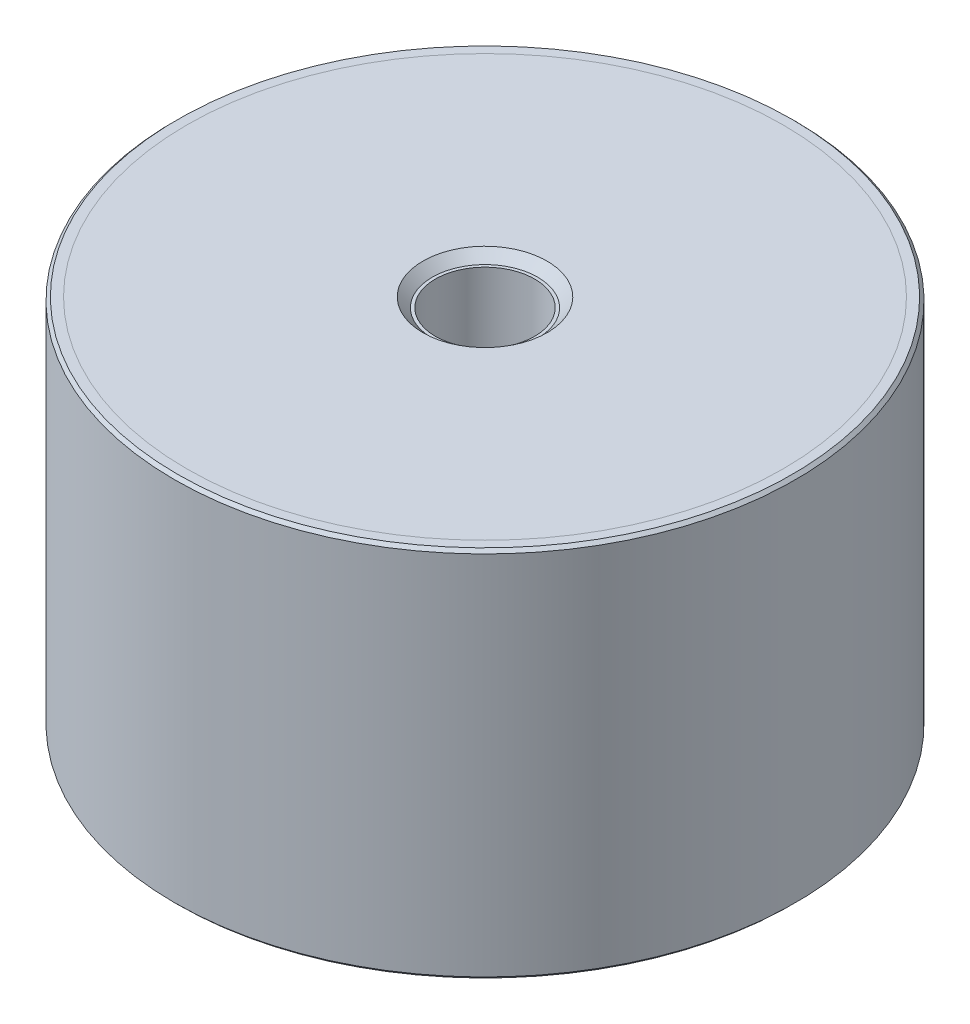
ISO-10303-21;
HEADER;
FILE_DESCRIPTION(('STEP AP214'),'2;1');
FILE_NAME('part.step','',(''),(''),'','','');
FILE_SCHEMA(('AUTOMOTIVE_DESIGN { 1 0 10303 214 1 1 1 1 }'));
ENDSEC;
DATA;
#1=APPLICATION_CONTEXT('core data for automotive mechanical design processes');
#2=APPLICATION_PROTOCOL_DEFINITION('international standard','automotive_design',2000,#1);
#3=PRODUCT_CONTEXT('',#1,'mechanical');
#4=PRODUCT('Part','Part','',(#3));
#5=PRODUCT_RELATED_PRODUCT_CATEGORY('part','',(#4));
#6=PRODUCT_DEFINITION_FORMATION('','',#4);
#7=PRODUCT_DEFINITION_CONTEXT('part definition',#1,'design');
#8=PRODUCT_DEFINITION('design','',#6,#7);
#9=PRODUCT_DEFINITION_SHAPE('','',#8);
#10=(LENGTH_UNIT() NAMED_UNIT(*) SI_UNIT(.MILLI.,.METRE.));
#11=(NAMED_UNIT(*) PLANE_ANGLE_UNIT() SI_UNIT($,.RADIAN.));
#12=(NAMED_UNIT(*) SI_UNIT($,.STERADIAN.) SOLID_ANGLE_UNIT());
#13=UNCERTAINTY_MEASURE_WITH_UNIT(LENGTH_MEASURE(1.E-05),#10,'distance_accuracy_value','');
#14=(GEOMETRIC_REPRESENTATION_CONTEXT(3) GLOBAL_UNCERTAINTY_ASSIGNED_CONTEXT((#13)) GLOBAL_UNIT_ASSIGNED_CONTEXT((#10,
#11,#12)) REPRESENTATION_CONTEXT('',''));
#15=CARTESIAN_POINT('',(0.,0.,0.));
#16=DIRECTION('',(0.,0.,1.));
#17=DIRECTION('',(1.,0.,0.));
#18=AXIS2_PLACEMENT_3D('',#15,#16,#17);
#19=CARTESIAN_POINT('',(0.,-57.,8.));
#20=DIRECTION('',(0.,1.,0.));
#21=DIRECTION('',(0.,0.,1.));
#22=AXIS2_PLACEMENT_3D('',#19,#20,#21);
#23=PLANE('',#22);
#24=CARTESIAN_POINT('',(0.,-57.,0.));
#25=DIRECTION('',(0.,1.,0.));
#26=DIRECTION('',(0.,0.,1.));
#27=AXIS2_PLACEMENT_3D('',#24,#25,#26);
#28=CIRCLE('',#27,8.50000000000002);
#29=CARTESIAN_POINT('',(0.,-57.,8.50000000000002));
#30=VERTEX_POINT('',#29);
#31=EDGE_CURVE('P0_E10',#30,#30,#28,.F.);
#32=ORIENTED_EDGE('',*,*,#31,.T.);
#33=EDGE_LOOP('',(#32));
#34=FACE_BOUND('',#33,.T.);
#35=CARTESIAN_POINT('',(0.,-57.,0.));
#36=DIRECTION('',(0.,1.,0.));
#37=DIRECTION('',(0.,0.,1.));
#38=AXIS2_PLACEMENT_3D('',#35,#36,#37);
#39=CIRCLE('',#38,48.);
#40=CARTESIAN_POINT('',(0.,-57.,48.));
#41=VERTEX_POINT('',#40);
#42=EDGE_CURVE('P0_E25',#41,#41,#39,.T.);
#43=ORIENTED_EDGE('',*,*,#42,.T.);
#44=EDGE_LOOP('',(#43));
#45=FACE_BOUND('',#44,.T.);
#46=ADVANCED_FACE('P0_F14',(#34,#45),#23,.T.);
#47=CARTESIAN_POINT('',(0.,11.0340428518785,0.));
#48=DIRECTION('',(0.,1.,0.));
#49=DIRECTION('',(0.,0.,1.));
#50=AXIS2_PLACEMENT_3D('',#47,#48,#49);
#51=CYLINDRICAL_SURFACE('',#50,48.);
#52=CARTESIAN_POINT('',(0.,-58.5,0.));
#53=DIRECTION('',(0.,1.,0.));
#54=DIRECTION('',(0.,0.,1.));
#55=AXIS2_PLACEMENT_3D('',#52,#53,#54);
#56=CIRCLE('',#55,48.);
#57=CARTESIAN_POINT('',(0.,-58.5,48.));
#58=VERTEX_POINT('',#57);
#59=EDGE_CURVE('P0_E29',#58,#58,#56,.T.);
#60=ORIENTED_EDGE('',*,*,#59,.T.);
#61=EDGE_LOOP('',(#60));
#62=FACE_BOUND('',#61,.T.);
#63=ORIENTED_EDGE('',*,*,#42,.F.);
#64=EDGE_LOOP('',(#63));
#65=FACE_BOUND('',#64,.T.);
#66=ADVANCED_FACE('P0_F35',(#62,#65),#51,.T.);
#67=CARTESIAN_POINT('',(0.,-58.5,48.));
#68=DIRECTION('',(0.,-1.,0.));
#69=DIRECTION('',(0.,0.,-1.));
#70=AXIS2_PLACEMENT_3D('',#67,#68,#69);
#71=PLANE('',#70);
#72=CARTESIAN_POINT('',(0.,-58.5,0.));
#73=DIRECTION('',(0.,-1.,0.));
#74=DIRECTION('',(0.,0.,-1.));
#75=AXIS2_PLACEMENT_3D('',#72,#73,#74);
#76=CIRCLE('',#75,10.);
#77=CARTESIAN_POINT('',(0.,-58.5,-10.));
#78=VERTEX_POINT('',#77);
#79=EDGE_CURVE('P0_E21',#78,#78,#76,.F.);
#80=ORIENTED_EDGE('',*,*,#79,.T.);
#81=EDGE_LOOP('',(#80));
#82=FACE_BOUND('',#81,.T.);
#83=ORIENTED_EDGE('',*,*,#59,.F.);
#84=EDGE_LOOP('',(#83));
#85=FACE_BOUND('',#84,.T.);
#86=ADVANCED_FACE('P0_F38',(#82,#85),#71,.T.);
#87=CARTESIAN_POINT('',(0.,-58.5,0.));
#88=DIRECTION('',(0.,-1.,0.));
#89=DIRECTION('',(0.,0.,-1.));
#90=AXIS2_PLACEMENT_3D('',#87,#88,#89);
#91=CONICAL_SURFACE('',#90,10.,0.785398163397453);
#92=ORIENTED_EDGE('',*,*,#31,.F.);
#93=EDGE_LOOP('',(#92));
#94=FACE_BOUND('',#93,.T.);
#95=ORIENTED_EDGE('',*,*,#79,.F.);
#96=EDGE_LOOP('',(#95));
#97=FACE_BOUND('',#96,.T.);
#98=ADVANCED_FACE('P0_F16',(#94,#97),#91,.F.);
#99=CLOSED_SHELL('',(#46,#66,#86,#98));
#100=MANIFOLD_SOLID_BREP('P0_B1',#99);
#101=CARTESIAN_POINT('',(0.,1.5,8.));
#102=DIRECTION('',(0.,1.,0.));
#103=DIRECTION('',(0.,0.,1.));
#104=AXIS2_PLACEMENT_3D('',#101,#102,#103);
#105=PLANE('',#104);
#106=CARTESIAN_POINT('',(0.,1.5,0.));
#107=DIRECTION('',(0.,1.,0.));
#108=DIRECTION('',(0.,0.,1.));
#109=AXIS2_PLACEMENT_3D('',#106,#107,#108);
#110=CIRCLE('',#109,10.);
#111=CARTESIAN_POINT('',(0.,1.5,10.));
#112=VERTEX_POINT('',#111);
#113=EDGE_CURVE('P1_E10',#112,#112,#110,.F.);
#114=ORIENTED_EDGE('',*,*,#113,.T.);
#115=EDGE_LOOP('',(#114));
#116=FACE_BOUND('',#115,.T.);
#117=CARTESIAN_POINT('',(0.,1.5,0.));
#118=DIRECTION('',(0.,1.,0.));
#119=DIRECTION('',(0.,0.,1.));
#120=AXIS2_PLACEMENT_3D('',#117,#118,#119);
#121=CIRCLE('',#120,48.);
#122=CARTESIAN_POINT('',(0.,1.5,48.));
#123=VERTEX_POINT('',#122);
#124=EDGE_CURVE('P1_E25',#123,#123,#121,.T.);
#125=ORIENTED_EDGE('',*,*,#124,.T.);
#126=EDGE_LOOP('',(#125));
#127=FACE_BOUND('',#126,.T.);
#128=ADVANCED_FACE('P1_F14',(#116,#127),#105,.T.);
#129=CARTESIAN_POINT('',(0.,69.5340428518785,0.));
#130=DIRECTION('',(0.,1.,0.));
#131=DIRECTION('',(0.,0.,1.));
#132=AXIS2_PLACEMENT_3D('',#129,#130,#131);
#133=CYLINDRICAL_SURFACE('',#132,48.);
#134=CARTESIAN_POINT('',(0.,0.,0.));
#135=DIRECTION('',(0.,1.,0.));
#136=DIRECTION('',(0.,0.,1.));
#137=AXIS2_PLACEMENT_3D('',#134,#135,#136);
#138=CIRCLE('',#137,48.);
#139=CARTESIAN_POINT('',(0.,0.,48.));
#140=VERTEX_POINT('',#139);
#141=EDGE_CURVE('P1_E29',#140,#140,#138,.T.);
#142=ORIENTED_EDGE('',*,*,#141,.T.);
#143=EDGE_LOOP('',(#142));
#144=FACE_BOUND('',#143,.T.);
#145=ORIENTED_EDGE('',*,*,#124,.F.);
#146=EDGE_LOOP('',(#145));
#147=FACE_BOUND('',#146,.T.);
#148=ADVANCED_FACE('P1_F35',(#144,#147),#133,.T.);
#149=CARTESIAN_POINT('',(0.,0.,48.));
#150=DIRECTION('',(0.,-1.,0.));
#151=DIRECTION('',(0.,0.,-1.));
#152=AXIS2_PLACEMENT_3D('',#149,#150,#151);
#153=PLANE('',#152);
#154=CARTESIAN_POINT('',(0.,0.,0.));
#155=DIRECTION('',(0.,-1.,0.));
#156=DIRECTION('',(0.,0.,-1.));
#157=AXIS2_PLACEMENT_3D('',#154,#155,#156);
#158=CIRCLE('',#157,8.50000000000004);
#159=CARTESIAN_POINT('',(0.,0.,-8.50000000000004));
#160=VERTEX_POINT('',#159);
#161=EDGE_CURVE('P1_E21',#160,#160,#158,.F.);
#162=ORIENTED_EDGE('',*,*,#161,.T.);
#163=EDGE_LOOP('',(#162));
#164=FACE_BOUND('',#163,.T.);
#165=ORIENTED_EDGE('',*,*,#141,.F.);
#166=EDGE_LOOP('',(#165));
#167=FACE_BOUND('',#166,.T.);
#168=ADVANCED_FACE('P1_F38',(#164,#167),#153,.T.);
#169=CARTESIAN_POINT('',(0.,-0.500000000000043,0.));
#170=DIRECTION('',(0.,1.,0.));
#171=DIRECTION('',(0.,0.,1.));
#172=AXIS2_PLACEMENT_3D('',#169,#170,#171);
#173=CONICAL_SURFACE('',#172,8.,0.785398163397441);
#174=ORIENTED_EDGE('',*,*,#113,.F.);
#175=EDGE_LOOP('',(#174));
#176=FACE_BOUND('',#175,.T.);
#177=ORIENTED_EDGE('',*,*,#161,.F.);
#178=EDGE_LOOP('',(#177));
#179=FACE_BOUND('',#178,.T.);
#180=ADVANCED_FACE('P1_F16',(#176,#179),#173,.F.);
#181=CLOSED_SHELL('',(#128,#148,#168,#180));
#182=MANIFOLD_SOLID_BREP('P1_B1',#181);
#183=CARTESIAN_POINT('',(0.,0.,0.));
#184=DIRECTION('',(0.,1.,0.));
#185=DIRECTION('',(0.,0.,1.));
#186=AXIS2_PLACEMENT_3D('',#183,#184,#185);
#187=PLANE('',#186);
#188=CARTESIAN_POINT('',(0.,0.,0.));
#189=DIRECTION('',(0.,1.,0.));
#190=DIRECTION('',(0.,0.,1.));
#191=AXIS2_PLACEMENT_3D('',#188,#189,#190);
#192=CIRCLE('',#191,8.);
#193=CARTESIAN_POINT('',(0.,0.,8.));
#194=VERTEX_POINT('',#193);
#195=EDGE_CURVE('P2_E46',#194,#194,#192,.T.);
#196=ORIENTED_EDGE('',*,*,#195,.F.);
#197=EDGE_LOOP('',(#196));
#198=FACE_BOUND('',#197,.T.);
#199=CARTESIAN_POINT('',(0.,0.,0.));
#200=DIRECTION('',(0.,1.,0.));
#201=DIRECTION('',(0.,0.,1.));
#202=AXIS2_PLACEMENT_3D('',#199,#200,#201);
#203=CIRCLE('',#202,48.);
#204=CARTESIAN_POINT('',(0.,0.,48.));
#205=VERTEX_POINT('',#204);
#206=EDGE_CURVE('P2_E33',#205,#205,#203,.T.);
#207=ORIENTED_EDGE('',*,*,#206,.T.);
#208=EDGE_LOOP('',(#207));
#209=FACE_BOUND('',#208,.T.);
#210=ADVANCED_FACE('P2_F13',(#198,#209),#187,.T.);
#211=CARTESIAN_POINT('',(0.,65.5134936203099,0.));
#212=DIRECTION('',(0.,1.,0.));
#213=DIRECTION('',(0.,0.,1.));
#214=AXIS2_PLACEMENT_3D('',#211,#212,#213);
#215=CYLINDRICAL_SURFACE('',#214,48.);
#216=CARTESIAN_POINT('',(0.,1.49999999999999,0.));
#217=DIRECTION('',(0.,1.,0.));
#218=DIRECTION('',(0.,0.,1.));
#219=AXIS2_PLACEMENT_3D('',#216,#217,#218);
#220=CIRCLE('',#219,48.);
#221=CARTESIAN_POINT('',(0.,1.49999999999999,48.));
#222=VERTEX_POINT('',#221);
#223=EDGE_CURVE('P2_E36',#222,#222,#220,.T.);
#224=ORIENTED_EDGE('',*,*,#223,.T.);
#225=EDGE_LOOP('',(#224));
#226=FACE_BOUND('',#225,.T.);
#227=ORIENTED_EDGE('',*,*,#206,.F.);
#228=EDGE_LOOP('',(#227));
#229=FACE_BOUND('',#228,.T.);
#230=ADVANCED_FACE('P2_F92',(#226,#229),#215,.F.);
#231=CARTESIAN_POINT('',(0.,1.49999999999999,48.));
#232=DIRECTION('',(0.,1.,0.));
#233=DIRECTION('',(0.,0.,1.));
#234=AXIS2_PLACEMENT_3D('',#231,#232,#233);
#235=PLANE('',#234);
#236=CARTESIAN_POINT('',(0.,1.49999999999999,0.));
#237=DIRECTION('',(0.,1.,0.));
#238=DIRECTION('',(0.,0.,1.));
#239=AXIS2_PLACEMENT_3D('',#236,#237,#238);
#240=CIRCLE('',#239,49.5);
#241=CARTESIAN_POINT('',(0.,1.49999999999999,49.5));
#242=VERTEX_POINT('',#241);
#243=EDGE_CURVE('P2_E9',#242,#242,#240,.T.);
#244=ORIENTED_EDGE('',*,*,#243,.T.);
#245=EDGE_LOOP('',(#244));
#246=FACE_BOUND('',#245,.T.);
#247=ORIENTED_EDGE('',*,*,#223,.F.);
#248=EDGE_LOOP('',(#247));
#249=FACE_BOUND('',#248,.T.);
#250=ADVANCED_FACE('P2_F88',(#246,#249),#235,.T.);
#251=CARTESIAN_POINT('',(0.,65.5134936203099,0.));
#252=DIRECTION('',(0.,1.,0.));
#253=DIRECTION('',(0.,0.,1.));
#254=AXIS2_PLACEMENT_3D('',#251,#252,#253);
#255=CYLINDRICAL_SURFACE('',#254,50.);
#256=CARTESIAN_POINT('',(0.,-58.,0.));
#257=DIRECTION('',(0.,-1.,0.));
#258=DIRECTION('',(0.,0.,-1.));
#259=AXIS2_PLACEMENT_3D('',#256,#257,#258);
#260=CIRCLE('',#259,50.);
#261=CARTESIAN_POINT('',(0.,-58.,-50.));
#262=VERTEX_POINT('',#261);
#263=EDGE_CURVE('P2_E24',#262,#262,#260,.F.);
#264=ORIENTED_EDGE('',*,*,#263,.T.);
#265=EDGE_LOOP('',(#264));
#266=FACE_BOUND('',#265,.T.);
#267=CARTESIAN_POINT('',(0.,0.999999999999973,0.));
#268=DIRECTION('',(0.,1.,0.));
#269=DIRECTION('',(0.,0.,1.));
#270=AXIS2_PLACEMENT_3D('',#267,#268,#269);
#271=CIRCLE('',#270,50.);
#272=CARTESIAN_POINT('',(0.,0.999999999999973,50.));
#273=VERTEX_POINT('',#272);
#274=EDGE_CURVE('P2_E28',#273,#273,#271,.F.);
#275=ORIENTED_EDGE('',*,*,#274,.T.);
#276=EDGE_LOOP('',(#275));
#277=FACE_BOUND('',#276,.T.);
#278=ADVANCED_FACE('P2_F82',(#266,#277),#255,.T.);
#279=CARTESIAN_POINT('',(0.,-58.5,50.));
#280=DIRECTION('',(0.,-1.,0.));
#281=DIRECTION('',(0.,0.,-1.));
#282=AXIS2_PLACEMENT_3D('',#279,#280,#281);
#283=PLANE('',#282);
#284=CARTESIAN_POINT('',(0.,-58.5,0.));
#285=DIRECTION('',(0.,-1.,0.));
#286=DIRECTION('',(0.,0.,-1.));
#287=AXIS2_PLACEMENT_3D('',#284,#285,#286);
#288=CIRCLE('',#287,49.5);
#289=CARTESIAN_POINT('',(0.,-58.5,-49.5));
#290=VERTEX_POINT('',#289);
#291=EDGE_CURVE('P2_E20',#290,#290,#288,.T.);
#292=ORIENTED_EDGE('',*,*,#291,.T.);
#293=EDGE_LOOP('',(#292));
#294=FACE_BOUND('',#293,.T.);
#295=CARTESIAN_POINT('',(0.,-58.5,0.));
#296=DIRECTION('',(0.,1.,0.));
#297=DIRECTION('',(0.,0.,1.));
#298=AXIS2_PLACEMENT_3D('',#295,#296,#297);
#299=CIRCLE('',#298,48.);
#300=CARTESIAN_POINT('',(0.,-58.5,48.));
#301=VERTEX_POINT('',#300);
#302=EDGE_CURVE('P2_E39',#301,#301,#299,.T.);
#303=ORIENTED_EDGE('',*,*,#302,.T.);
#304=EDGE_LOOP('',(#303));
#305=FACE_BOUND('',#304,.T.);
#306=ADVANCED_FACE('P2_F77',(#294,#305),#283,.T.);
#307=CARTESIAN_POINT('',(0.,65.5134936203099,0.));
#308=DIRECTION('',(0.,1.,0.));
#309=DIRECTION('',(0.,0.,1.));
#310=AXIS2_PLACEMENT_3D('',#307,#308,#309);
#311=CYLINDRICAL_SURFACE('',#310,48.);
#312=CARTESIAN_POINT('',(0.,-57.,0.));
#313=DIRECTION('',(0.,1.,0.));
#314=DIRECTION('',(0.,0.,1.));
#315=AXIS2_PLACEMENT_3D('',#312,#313,#314);
#316=CIRCLE('',#315,48.);
#317=CARTESIAN_POINT('',(0.,-57.,48.));
#318=VERTEX_POINT('',#317);
#319=EDGE_CURVE('P2_E42',#318,#318,#316,.T.);
#320=ORIENTED_EDGE('',*,*,#319,.T.);
#321=EDGE_LOOP('',(#320));
#322=FACE_BOUND('',#321,.T.);
#323=ORIENTED_EDGE('',*,*,#302,.F.);
#324=EDGE_LOOP('',(#323));
#325=FACE_BOUND('',#324,.T.);
#326=ADVANCED_FACE('P2_F71',(#322,#325),#311,.F.);
#327=CARTESIAN_POINT('',(0.,-57.,48.));
#328=DIRECTION('',(0.,-1.,0.));
#329=DIRECTION('',(0.,0.,-1.));
#330=AXIS2_PLACEMENT_3D('',#327,#328,#329);
#331=PLANE('',#330);
#332=CARTESIAN_POINT('',(0.,-57.,0.));
#333=DIRECTION('',(0.,-1.,0.));
#334=DIRECTION('',(0.,0.,-1.));
#335=AXIS2_PLACEMENT_3D('',#332,#333,#334);
#336=CIRCLE('',#335,8.);
#337=CARTESIAN_POINT('',(0.,-57.,-8.));
#338=VERTEX_POINT('',#337);
#339=EDGE_CURVE('P2_E52',#338,#338,#336,.T.);
#340=ORIENTED_EDGE('',*,*,#339,.F.);
#341=EDGE_LOOP('',(#340));
#342=FACE_BOUND('',#341,.T.);
#343=ORIENTED_EDGE('',*,*,#319,.F.);
#344=EDGE_LOOP('',(#343));
#345=FACE_BOUND('',#344,.T.);
#346=ADVANCED_FACE('P2_F67',(#342,#345),#331,.T.);
#347=CARTESIAN_POINT('',(0.,-58.,0.));
#348=DIRECTION('',(0.,1.,0.));
#349=DIRECTION('',(0.,0.,1.));
#350=AXIS2_PLACEMENT_3D('',#347,#348,#349);
#351=CONICAL_SURFACE('',#350,50.,0.785398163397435);
#352=ORIENTED_EDGE('',*,*,#291,.F.);
#353=EDGE_LOOP('',(#352));
#354=FACE_BOUND('',#353,.T.);
#355=ORIENTED_EDGE('',*,*,#263,.F.);
#356=EDGE_LOOP('',(#355));
#357=FACE_BOUND('',#356,.T.);
#358=ADVANCED_FACE('P2_F70',(#354,#357),#351,.T.);
#359=CARTESIAN_POINT('',(0.,1.49999999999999,0.));
#360=DIRECTION('',(0.,-1.,0.));
#361=DIRECTION('',(0.,0.,-1.));
#362=AXIS2_PLACEMENT_3D('',#359,#360,#361);
#363=CONICAL_SURFACE('',#362,49.5,0.785398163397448);
#364=ORIENTED_EDGE('',*,*,#274,.F.);
#365=EDGE_LOOP('',(#364));
#366=FACE_BOUND('',#365,.T.);
#367=ORIENTED_EDGE('',*,*,#243,.F.);
#368=EDGE_LOOP('',(#367));
#369=FACE_BOUND('',#368,.T.);
#370=ADVANCED_FACE('P2_F15',(#366,#369),#363,.T.);
#371=CARTESIAN_POINT('',(0.,-14.5,0.));
#372=DIRECTION('',(0.,1.,0.));
#373=DIRECTION('',(0.,0.,1.));
#374=AXIS2_PLACEMENT_3D('',#371,#372,#373);
#375=CYLINDRICAL_SURFACE('',#374,8.);
#376=CARTESIAN_POINT('',(0.,-14.5,0.));
#377=DIRECTION('',(0.,1.,0.));
#378=DIRECTION('',(0.,0.,1.));
#379=AXIS2_PLACEMENT_3D('',#376,#377,#378);
#380=CIRCLE('',#379,8.);
#381=CARTESIAN_POINT('',(0.,-14.5,8.));
#382=VERTEX_POINT('',#381);
#383=EDGE_CURVE('P2_E45',#382,#382,#380,.T.);
#384=CARTESIAN_POINT('',(0.,-14.5,8.));
#385=CARTESIAN_POINT('',(0.,-14.3489583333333,8.));
#386=CARTESIAN_POINT('',(0.,-14.1979166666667,8.));
#387=CARTESIAN_POINT('',(0.,-13.8958333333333,8.));
#388=CARTESIAN_POINT('',(0.,-13.7447916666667,8.));
#389=CARTESIAN_POINT('',(0.,-13.4427083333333,8.));
#390=CARTESIAN_POINT('',(0.,-13.2916666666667,8.));
#391=CARTESIAN_POINT('',(0.,-12.9895833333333,8.));
#392=CARTESIAN_POINT('',(0.,-12.8385416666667,8.));
#393=CARTESIAN_POINT('',(0.,-12.5364583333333,8.));
#394=CARTESIAN_POINT('',(0.,-12.3854166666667,8.));
#395=CARTESIAN_POINT('',(0.,-12.0833333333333,8.));
#396=CARTESIAN_POINT('',(0.,-11.9322916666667,8.));
#397=CARTESIAN_POINT('',(0.,-11.6302083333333,8.));
#398=CARTESIAN_POINT('',(0.,-11.4791666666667,8.));
#399=CARTESIAN_POINT('',(0.,-11.1770833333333,8.));
#400=CARTESIAN_POINT('',(0.,-11.0260416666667,8.));
#401=CARTESIAN_POINT('',(0.,-10.7239583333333,8.));
#402=CARTESIAN_POINT('',(0.,-10.5729166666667,8.));
#403=CARTESIAN_POINT('',(0.,-10.2708333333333,8.));
#404=CARTESIAN_POINT('',(0.,-10.1197916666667,8.));
#405=CARTESIAN_POINT('',(0.,-9.81770833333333,8.));
#406=CARTESIAN_POINT('',(0.,-9.66666666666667,8.));
#407=CARTESIAN_POINT('',(0.,-9.36458333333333,8.));
#408=CARTESIAN_POINT('',(0.,-9.21354166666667,8.));
#409=CARTESIAN_POINT('',(0.,-8.91145833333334,8.));
#410=CARTESIAN_POINT('',(0.,-8.76041666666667,8.));
#411=CARTESIAN_POINT('',(0.,-8.45833333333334,8.));
#412=CARTESIAN_POINT('',(0.,-8.30729166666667,8.));
#413=CARTESIAN_POINT('',(0.,-8.00520833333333,8.));
#414=CARTESIAN_POINT('',(0.,-7.85416666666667,8.));
#415=CARTESIAN_POINT('',(0.,-7.55208333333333,8.));
#416=CARTESIAN_POINT('',(0.,-7.40104166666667,8.));
#417=CARTESIAN_POINT('',(0.,-7.09895833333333,8.));
#418=CARTESIAN_POINT('',(0.,-6.94791666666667,8.));
#419=CARTESIAN_POINT('',(0.,-6.64583333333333,8.));
#420=CARTESIAN_POINT('',(0.,-6.49479166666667,8.));
#421=CARTESIAN_POINT('',(0.,-6.19270833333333,8.));
#422=CARTESIAN_POINT('',(0.,-6.04166666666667,8.));
#423=CARTESIAN_POINT('',(0.,-5.73958333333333,8.));
#424=CARTESIAN_POINT('',(0.,-5.58854166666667,8.));
#425=CARTESIAN_POINT('',(0.,-5.28645833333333,8.));
#426=CARTESIAN_POINT('',(0.,-5.13541666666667,8.));
#427=CARTESIAN_POINT('',(0.,-4.83333333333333,8.));
#428=CARTESIAN_POINT('',(0.,-4.68229166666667,8.));
#429=CARTESIAN_POINT('',(0.,-4.38020833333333,8.));
#430=CARTESIAN_POINT('',(0.,-4.22916666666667,8.));
#431=CARTESIAN_POINT('',(0.,-3.92708333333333,8.));
#432=CARTESIAN_POINT('',(0.,-3.77604166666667,8.));
#433=CARTESIAN_POINT('',(0.,-3.47395833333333,8.));
#434=CARTESIAN_POINT('',(0.,-3.32291666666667,8.));
#435=CARTESIAN_POINT('',(0.,-3.02083333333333,8.));
#436=CARTESIAN_POINT('',(0.,-2.86979166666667,8.));
#437=CARTESIAN_POINT('',(0.,-2.56770833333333,8.));
#438=CARTESIAN_POINT('',(0.,-2.41666666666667,8.));
#439=CARTESIAN_POINT('',(0.,-2.11458333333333,8.));
#440=CARTESIAN_POINT('',(0.,-1.96354166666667,8.));
#441=CARTESIAN_POINT('',(0.,-1.66145833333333,8.));
#442=CARTESIAN_POINT('',(0.,-1.51041666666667,8.));
#443=CARTESIAN_POINT('',(0.,-1.20833333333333,8.));
#444=CARTESIAN_POINT('',(0.,-1.05729166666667,8.));
#445=CARTESIAN_POINT('',(0.,-0.755208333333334,8.));
#446=CARTESIAN_POINT('',(0.,-0.604166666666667,8.));
#447=CARTESIAN_POINT('',(0.,-0.302083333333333,8.));
#448=CARTESIAN_POINT('',(0.,-0.151041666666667,8.));
#449=CARTESIAN_POINT('',(0.,0.,8.));
#450=B_SPLINE_CURVE_WITH_KNOTS('',3,(#384,#385,#386,#387,#388,#389,#390,#391,#392,#393,#394,
#395,#396,#397,#398,#399,#400,#401,#402,#403,#404,#405,#406,#407,#408,#409,#410,#411,#412,#413,
#414,#415,#416,#417,#418,#419,#420,#421,#422,#423,#424,#425,#426,#427,#428,#429,#430,#431,#432,
#433,#434,#435,#436,#437,#438,#439,#440,#441,#442,#443,#444,#445,#446,#447,#448,#449),
.UNSPECIFIED.,.F.,.F.,(4,2,2,2,2,2,2,2,2,2,2,2,2,2,2,2,2,2,2,2,2,2,2,2,2,2,2,2,2,2,2,2,4),(0.,
0.453124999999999,0.906249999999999,1.359375,1.8125,2.265625,2.71875,3.171875,3.625,4.078125,
4.53125,4.984375,5.4375,5.890625,6.34375,6.796875,7.25,7.703125,8.15625,8.609375,9.0625,
9.515625,9.96875,10.421875,10.875,11.328125,11.78125,12.234375,12.6875,13.140625,13.59375,
14.046875,14.5),.UNSPECIFIED.);
#451=EDGE_CURVE('P2_BSEAM108',#382,#194,#450,.T.);
#452=ORIENTED_EDGE('',*,*,#383,.F.);
#453=ORIENTED_EDGE('',*,*,#195,.T.);
#454=ORIENTED_EDGE('',*,*,#451,.T.);
#455=ORIENTED_EDGE('',*,*,#451,.F.);
#456=EDGE_LOOP('',(#452,#454,#453,#455));
#457=FACE_BOUND('',#456,.T.);
#458=ADVANCED_FACE('P2_F108',(#457),#375,.F.);
#459=CARTESIAN_POINT('',(0.,-14.5,0.));
#460=DIRECTION('',(0.,1.,0.));
#461=DIRECTION('',(0.,0.,1.));
#462=AXIS2_PLACEMENT_3D('',#459,#460,#461);
#463=PLANE('',#462);
#464=ORIENTED_EDGE('',*,*,#383,.T.);
#465=EDGE_LOOP('',(#464));
#466=FACE_BOUND('',#465,.T.);
#467=ADVANCED_FACE('P2_F63',(#466),#463,.T.);
#468=CARTESIAN_POINT('',(0.,-42.5,0.));
#469=DIRECTION('',(0.,-1.,0.));
#470=DIRECTION('',(0.,0.,-1.));
#471=AXIS2_PLACEMENT_3D('',#468,#469,#470);
#472=CYLINDRICAL_SURFACE('',#471,8.);
#473=CARTESIAN_POINT('',(0.,-42.5,0.));
#474=DIRECTION('',(0.,-1.,0.));
#475=DIRECTION('',(0.,0.,-1.));
#476=AXIS2_PLACEMENT_3D('',#473,#474,#475);
#477=CIRCLE('',#476,8.);
#478=CARTESIAN_POINT('',(0.,-42.5,-8.));
#479=VERTEX_POINT('',#478);
#480=EDGE_CURVE('P2_E49',#479,#479,#477,.T.);
#481=CARTESIAN_POINT('',(0.,-42.5,-8.));
#482=CARTESIAN_POINT('',(0.,-42.6510416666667,-8.));
#483=CARTESIAN_POINT('',(0.,-42.8020833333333,-8.));
#484=CARTESIAN_POINT('',(0.,-43.1041666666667,-8.));
#485=CARTESIAN_POINT('',(0.,-43.2552083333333,-8.));
#486=CARTESIAN_POINT('',(0.,-43.5572916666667,-8.));
#487=CARTESIAN_POINT('',(0.,-43.7083333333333,-8.));
#488=CARTESIAN_POINT('',(0.,-44.0104166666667,-8.));
#489=CARTESIAN_POINT('',(0.,-44.1614583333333,-8.));
#490=CARTESIAN_POINT('',(0.,-44.4635416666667,-8.));
#491=CARTESIAN_POINT('',(0.,-44.6145833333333,-8.));
#492=CARTESIAN_POINT('',(0.,-44.9166666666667,-8.));
#493=CARTESIAN_POINT('',(0.,-45.0677083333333,-8.));
#494=CARTESIAN_POINT('',(0.,-45.3697916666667,-8.));
#495=CARTESIAN_POINT('',(0.,-45.5208333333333,-8.));
#496=CARTESIAN_POINT('',(0.,-45.8229166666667,-8.));
#497=CARTESIAN_POINT('',(0.,-45.9739583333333,-8.));
#498=CARTESIAN_POINT('',(0.,-46.2760416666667,-8.));
#499=CARTESIAN_POINT('',(0.,-46.4270833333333,-8.));
#500=CARTESIAN_POINT('',(0.,-46.7291666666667,-8.));
#501=CARTESIAN_POINT('',(0.,-46.8802083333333,-8.));
#502=CARTESIAN_POINT('',(0.,-47.1822916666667,-8.));
#503=CARTESIAN_POINT('',(0.,-47.3333333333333,-8.));
#504=CARTESIAN_POINT('',(0.,-47.6354166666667,-8.));
#505=CARTESIAN_POINT('',(0.,-47.7864583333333,-8.));
#506=CARTESIAN_POINT('',(0.,-48.0885416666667,-8.));
#507=CARTESIAN_POINT('',(0.,-48.2395833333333,-8.));
#508=CARTESIAN_POINT('',(0.,-48.5416666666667,-8.));
#509=CARTESIAN_POINT('',(0.,-48.6927083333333,-8.));
#510=CARTESIAN_POINT('',(0.,-48.9947916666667,-8.));
#511=CARTESIAN_POINT('',(0.,-49.1458333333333,-8.));
#512=CARTESIAN_POINT('',(0.,-49.4479166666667,-8.));
#513=CARTESIAN_POINT('',(0.,-49.5989583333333,-8.));
#514=CARTESIAN_POINT('',(0.,-49.9010416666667,-8.));
#515=CARTESIAN_POINT('',(0.,-50.0520833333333,-8.));
#516=CARTESIAN_POINT('',(0.,-50.3541666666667,-8.));
#517=CARTESIAN_POINT('',(0.,-50.5052083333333,-8.));
#518=CARTESIAN_POINT('',(0.,-50.8072916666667,-8.));
#519=CARTESIAN_POINT('',(0.,-50.9583333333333,-8.));
#520=CARTESIAN_POINT('',(0.,-51.2604166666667,-8.));
#521=CARTESIAN_POINT('',(0.,-51.4114583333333,-8.));
#522=CARTESIAN_POINT('',(0.,-51.7135416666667,-8.));
#523=CARTESIAN_POINT('',(0.,-51.8645833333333,-8.));
#524=CARTESIAN_POINT('',(0.,-52.1666666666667,-8.));
#525=CARTESIAN_POINT('',(0.,-52.3177083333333,-8.));
#526=CARTESIAN_POINT('',(0.,-52.6197916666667,-8.));
#527=CARTESIAN_POINT('',(0.,-52.7708333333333,-8.));
#528=CARTESIAN_POINT('',(0.,-53.0729166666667,-8.));
#529=CARTESIAN_POINT('',(0.,-53.2239583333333,-8.));
#530=CARTESIAN_POINT('',(0.,-53.5260416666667,-8.));
#531=CARTESIAN_POINT('',(0.,-53.6770833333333,-8.));
#532=CARTESIAN_POINT('',(0.,-53.9791666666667,-8.));
#533=CARTESIAN_POINT('',(0.,-54.1302083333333,-8.));
#534=CARTESIAN_POINT('',(0.,-54.4322916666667,-8.));
#535=CARTESIAN_POINT('',(0.,-54.5833333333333,-8.));
#536=CARTESIAN_POINT('',(0.,-54.8854166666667,-8.));
#537=CARTESIAN_POINT('',(0.,-55.0364583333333,-8.));
#538=CARTESIAN_POINT('',(0.,-55.3385416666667,-8.));
#539=CARTESIAN_POINT('',(0.,-55.4895833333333,-8.));
#540=CARTESIAN_POINT('',(0.,-55.7916666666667,-8.));
#541=CARTESIAN_POINT('',(0.,-55.9427083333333,-8.));
#542=CARTESIAN_POINT('',(0.,-56.2447916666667,-8.));
#543=CARTESIAN_POINT('',(0.,-56.3958333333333,-8.));
#544=CARTESIAN_POINT('',(0.,-56.6979166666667,-8.));
#545=CARTESIAN_POINT('',(0.,-56.8489583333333,-8.));
#546=CARTESIAN_POINT('',(0.,-57.,-8.));
#547=B_SPLINE_CURVE_WITH_KNOTS('',3,(#481,#482,#483,#484,#485,#486,#487,#488,#489,#490,#491,
#492,#493,#494,#495,#496,#497,#498,#499,#500,#501,#502,#503,#504,#505,#506,#507,#508,#509,#510,
#511,#512,#513,#514,#515,#516,#517,#518,#519,#520,#521,#522,#523,#524,#525,#526,#527,#528,#529,
#530,#531,#532,#533,#534,#535,#536,#537,#538,#539,#540,#541,#542,#543,#544,#545,#546),
.UNSPECIFIED.,.F.,.F.,(4,2,2,2,2,2,2,2,2,2,2,2,2,2,2,2,2,2,2,2,2,2,2,2,2,2,2,2,2,2,2,2,4),(0.,
0.453125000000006,0.906250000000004,1.359375,1.8125,2.265625,2.71875000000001,3.171875,3.625,
4.078125,4.53125,4.984375,5.4375,5.890625,6.34375,6.796875,7.25,7.70312500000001,8.15625,
8.609375,9.0625,9.515625,9.96875,10.421875,10.875,11.328125,11.78125,12.234375,12.6875,
13.140625,13.59375,14.046875,14.5),.UNSPECIFIED.);
#548=EDGE_CURVE('P2_BSEAM60',#479,#338,#547,.T.);
#549=ORIENTED_EDGE('',*,*,#480,.F.);
#550=ORIENTED_EDGE('',*,*,#339,.T.);
#551=ORIENTED_EDGE('',*,*,#548,.T.);
#552=ORIENTED_EDGE('',*,*,#548,.F.);
#553=EDGE_LOOP('',(#549,#551,#550,#552));
#554=FACE_BOUND('',#553,.T.);
#555=ADVANCED_FACE('P2_F60',(#554),#472,.F.);
#556=CARTESIAN_POINT('',(0.,-42.5,0.));
#557=DIRECTION('',(0.,-1.,0.));
#558=DIRECTION('',(0.,0.,-1.));
#559=AXIS2_PLACEMENT_3D('',#556,#557,#558);
#560=PLANE('',#559);
#561=ORIENTED_EDGE('',*,*,#480,.T.);
#562=EDGE_LOOP('',(#561));
#563=FACE_BOUND('',#562,.T.);
#564=ADVANCED_FACE('P2_F58',(#563),#560,.T.);
#565=CLOSED_SHELL('',(#210,#230,#250,#278,#306,#326,#346,#358,#370,#458,#467,#555,#564));
#566=MANIFOLD_SOLID_BREP('P2_B1',#565);
#567=ADVANCED_BREP_SHAPE_REPRESENTATION('',(#18,#100,#182,#566),#14);
#568=SHAPE_DEFINITION_REPRESENTATION(#9,#567);
ENDSEC;
END-ISO-10303-21;
